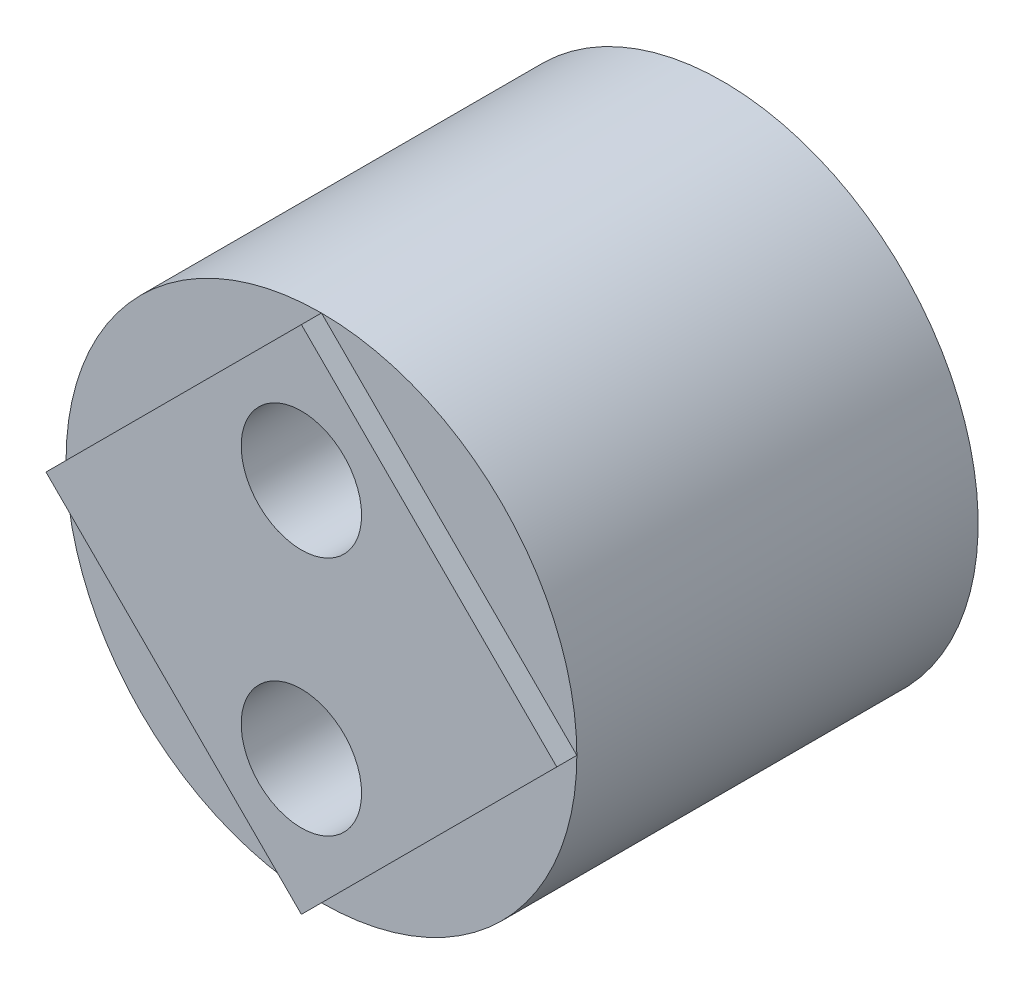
ISO-10303-21;
HEADER;
FILE_DESCRIPTION(('STEP AP214'),'2;1');
FILE_NAME('part.step','',(''),(''),'','','');
FILE_SCHEMA(('AUTOMOTIVE_DESIGN { 1 0 10303 214 1 1 1 1 }'));
ENDSEC;
DATA;
#1=APPLICATION_CONTEXT('core data for automotive mechanical design processes');
#2=APPLICATION_PROTOCOL_DEFINITION('international standard','automotive_design',2000,#1);
#3=PRODUCT_CONTEXT('',#1,'mechanical');
#4=PRODUCT('Part','Part','',(#3));
#5=PRODUCT_RELATED_PRODUCT_CATEGORY('part','',(#4));
#6=PRODUCT_DEFINITION_FORMATION('','',#4);
#7=PRODUCT_DEFINITION_CONTEXT('part definition',#1,'design');
#8=PRODUCT_DEFINITION('design','',#6,#7);
#9=PRODUCT_DEFINITION_SHAPE('','',#8);
#10=(LENGTH_UNIT() NAMED_UNIT(*) SI_UNIT(.MILLI.,.METRE.));
#11=(NAMED_UNIT(*) PLANE_ANGLE_UNIT() SI_UNIT($,.RADIAN.));
#12=(NAMED_UNIT(*) SI_UNIT($,.STERADIAN.) SOLID_ANGLE_UNIT());
#13=UNCERTAINTY_MEASURE_WITH_UNIT(LENGTH_MEASURE(1.E-05),#10,'distance_accuracy_value','');
#14=(GEOMETRIC_REPRESENTATION_CONTEXT(3) GLOBAL_UNCERTAINTY_ASSIGNED_CONTEXT((#13)) GLOBAL_UNIT_ASSIGNED_CONTEXT((#10,
#11,#12)) REPRESENTATION_CONTEXT('',''));
#15=CARTESIAN_POINT('',(0.,0.,0.));
#16=DIRECTION('',(0.,0.,1.));
#17=DIRECTION('',(1.,0.,0.));
#18=AXIS2_PLACEMENT_3D('',#15,#16,#17);
#19=CARTESIAN_POINT('',(0.,0.,-49.));
#20=DIRECTION('',(0.,0.,1.));
#21=DIRECTION('',(1.,0.,0.));
#22=AXIS2_PLACEMENT_3D('',#19,#20,#21);
#23=CYLINDRICAL_SURFACE('',#22,12.7279220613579);
#24=CARTESIAN_POINT('',(0.,0.,20.));
#25=DIRECTION('',(0.,0.,1.));
#26=DIRECTION('',(1.,0.,0.));
#27=AXIS2_PLACEMENT_3D('',#24,#25,#26);
#28=CIRCLE('',#27,12.7279220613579);
#29=CARTESIAN_POINT('',(0.,-12.7279220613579,20.));
#30=VERTEX_POINT('',#29);
#31=CARTESIAN_POINT('',(12.7279220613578,0.,20.));
#32=VERTEX_POINT('',#31);
#33=EDGE_CURVE('E67',#30,#32,#28,.T.);
#34=ORIENTED_EDGE('',*,*,#33,.F.);
#35=CARTESIAN_POINT('',(-12.7279220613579,0.,20.));
#36=VERTEX_POINT('',#35);
#37=EDGE_CURVE('E57',#36,#30,#28,.T.);
#38=ORIENTED_EDGE('',*,*,#37,.F.);
#39=CARTESIAN_POINT('',(0.,12.7279220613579,20.));
#40=VERTEX_POINT('',#39);
#41=EDGE_CURVE('E54',#40,#36,#28,.T.);
#42=ORIENTED_EDGE('',*,*,#41,.F.);
#43=EDGE_CURVE('E29',#32,#40,#28,.T.);
#44=ORIENTED_EDGE('',*,*,#43,.F.);
#45=EDGE_LOOP('',(#34,#38,#42,#44));
#46=FACE_BOUND('',#45,.T.);
#47=CARTESIAN_POINT('',(0.,0.,0.));
#48=DIRECTION('',(0.,0.,-1.));
#49=DIRECTION('',(-1.,0.,0.));
#50=AXIS2_PLACEMENT_3D('',#47,#48,#49);
#51=CIRCLE('',#50,12.7279220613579);
#52=CARTESIAN_POINT('',(-12.7279220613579,0.,0.));
#53=VERTEX_POINT('',#52);
#54=EDGE_CURVE('E60',#53,#53,#51,.T.);
#55=ORIENTED_EDGE('',*,*,#54,.F.);
#56=EDGE_LOOP('',(#55));
#57=FACE_BOUND('',#56,.T.);
#58=ADVANCED_FACE('F14',(#46,#57),#23,.T.);
#59=CARTESIAN_POINT('',(-17.5,-17.5,20.));
#60=DIRECTION('',(0.,0.,1.));
#61=DIRECTION('',(1.,0.,0.));
#62=AXIS2_PLACEMENT_3D('',#59,#60,#61);
#63=PLANE('',#62);
#64=DIRECTION('',(-0.707106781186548,0.707106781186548,0.));
#65=VECTOR('',#64,1.);
#66=CARTESIAN_POINT('',(0.,12.7279220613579,20.));
#67=LINE('',#66,#65);
#68=EDGE_CURVE('E65',#32,#40,#67,.T.);
#69=ORIENTED_EDGE('',*,*,#68,.F.);
#70=ORIENTED_EDGE('',*,*,#43,.T.);
#71=EDGE_LOOP('',(#69,#70));
#72=FACE_BOUND('',#71,.T.);
#73=ADVANCED_FACE('F16',(#72),#63,.T.);
#74=DIRECTION('',(-0.707106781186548,-0.707106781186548,0.));
#75=VECTOR('',#74,1.);
#76=CARTESIAN_POINT('',(-12.7279220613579,0.,20.));
#77=LINE('',#76,#75);
#78=EDGE_CURVE('E84',#40,#36,#77,.T.);
#79=ORIENTED_EDGE('',*,*,#78,.F.);
#80=ORIENTED_EDGE('',*,*,#41,.T.);
#81=EDGE_LOOP('',(#79,#80));
#82=FACE_BOUND('',#81,.T.);
#83=ADVANCED_FACE('F87',(#82),#63,.T.);
#84=DIRECTION('',(0.707106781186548,-0.707106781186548,0.));
#85=VECTOR('',#84,1.);
#86=CARTESIAN_POINT('',(-12.7279220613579,0.,20.));
#87=LINE('',#86,#85);
#88=EDGE_CURVE('E88',#36,#30,#87,.T.);
#89=ORIENTED_EDGE('',*,*,#88,.F.);
#90=ORIENTED_EDGE('',*,*,#37,.T.);
#91=EDGE_LOOP('',(#89,#90));
#92=FACE_BOUND('',#91,.T.);
#93=ADVANCED_FACE('F124',(#92),#63,.T.);
#94=DIRECTION('',(0.707106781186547,0.707106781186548,0.));
#95=VECTOR('',#94,1.);
#96=CARTESIAN_POINT('',(0.,-12.7279220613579,20.));
#97=LINE('',#96,#95);
#98=EDGE_CURVE('E78',#30,#32,#97,.T.);
#99=ORIENTED_EDGE('',*,*,#98,.F.);
#100=ORIENTED_EDGE('',*,*,#33,.T.);
#101=EDGE_LOOP('',(#99,#100));
#102=FACE_BOUND('',#101,.T.);
#103=ADVANCED_FACE('F109',(#102),#63,.T.);
#104=CARTESIAN_POINT('',(-12.7279220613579,0.,21.));
#105=DIRECTION('',(0.707106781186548,-0.707106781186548,0.));
#106=DIRECTION('',(0.707106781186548,0.707106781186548,0.));
#107=AXIS2_PLACEMENT_3D('',#104,#105,#106);
#108=PLANE('',#107);
#109=ORIENTED_EDGE('',*,*,#78,.T.);
#110=DIRECTION('',(0.,0.,-1.));
#111=VECTOR('',#110,1.);
#112=CARTESIAN_POINT('',(-12.7279220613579,0.,21.));
#113=LINE('',#112,#111);
#114=CARTESIAN_POINT('',(-12.7279220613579,0.,21.));
#115=VERTEX_POINT('',#114);
#116=EDGE_CURVE('E9',#115,#36,#113,.T.);
#117=ORIENTED_EDGE('',*,*,#116,.F.);
#118=DIRECTION('',(-0.707106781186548,-0.707106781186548,0.));
#119=VECTOR('',#118,1.);
#120=CARTESIAN_POINT('',(-12.7279220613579,0.,21.));
#121=LINE('',#120,#119);
#122=CARTESIAN_POINT('',(0.,12.7279220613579,21.));
#123=VERTEX_POINT('',#122);
#124=EDGE_CURVE('E77',#123,#115,#121,.T.);
#125=ORIENTED_EDGE('',*,*,#124,.F.);
#126=DIRECTION('',(0.,0.,-1.));
#127=VECTOR('',#126,1.);
#128=CARTESIAN_POINT('',(0.,12.7279220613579,21.));
#129=LINE('',#128,#127);
#130=EDGE_CURVE('E72',#123,#40,#129,.T.);
#131=ORIENTED_EDGE('',*,*,#130,.T.);
#132=EDGE_LOOP('',(#109,#117,#125,#131));
#133=FACE_BOUND('',#132,.T.);
#134=ADVANCED_FACE('F82',(#133),#108,.F.);
#135=CARTESIAN_POINT('',(-12.7279220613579,0.,21.));
#136=DIRECTION('',(0.707106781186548,0.707106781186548,0.));
#137=DIRECTION('',(-0.707106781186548,0.707106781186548,0.));
#138=AXIS2_PLACEMENT_3D('',#135,#136,#137);
#139=PLANE('',#138);
#140=ORIENTED_EDGE('',*,*,#88,.T.);
#141=DIRECTION('',(0.,0.,-1.));
#142=VECTOR('',#141,1.);
#143=CARTESIAN_POINT('',(0.,-12.7279220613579,21.));
#144=LINE('',#143,#142);
#145=CARTESIAN_POINT('',(0.,-12.7279220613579,21.));
#146=VERTEX_POINT('',#145);
#147=EDGE_CURVE('E22',#146,#30,#144,.T.);
#148=ORIENTED_EDGE('',*,*,#147,.F.);
#149=DIRECTION('',(0.707106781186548,-0.707106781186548,0.));
#150=VECTOR('',#149,1.);
#151=CARTESIAN_POINT('',(-12.7279220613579,0.,21.));
#152=LINE('',#151,#150);
#153=EDGE_CURVE('E120',#115,#146,#152,.T.);
#154=ORIENTED_EDGE('',*,*,#153,.F.);
#155=ORIENTED_EDGE('',*,*,#116,.T.);
#156=EDGE_LOOP('',(#140,#148,#154,#155));
#157=FACE_BOUND('',#156,.T.);
#158=ADVANCED_FACE('F122',(#157),#139,.F.);
#159=CARTESIAN_POINT('',(0.,-12.7279220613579,21.));
#160=DIRECTION('',(-0.707106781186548,0.707106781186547,0.));
#161=DIRECTION('',(-0.707106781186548,-0.707106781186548,0.));
#162=AXIS2_PLACEMENT_3D('',#159,#160,#161);
#163=PLANE('',#162);
#164=ORIENTED_EDGE('',*,*,#98,.T.);
#165=DIRECTION('',(0.,0.,-1.));
#166=VECTOR('',#165,1.);
#167=CARTESIAN_POINT('',(12.7279220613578,0.,21.));
#168=LINE('',#167,#166);
#169=CARTESIAN_POINT('',(12.7279220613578,0.,21.));
#170=VERTEX_POINT('',#169);
#171=EDGE_CURVE('E75',#170,#32,#168,.T.);
#172=ORIENTED_EDGE('',*,*,#171,.F.);
#173=DIRECTION('',(0.707106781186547,0.707106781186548,0.));
#174=VECTOR('',#173,1.);
#175=CARTESIAN_POINT('',(0.,-12.7279220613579,21.));
#176=LINE('',#175,#174);
#177=EDGE_CURVE('E106',#146,#170,#176,.T.);
#178=ORIENTED_EDGE('',*,*,#177,.F.);
#179=ORIENTED_EDGE('',*,*,#147,.T.);
#180=EDGE_LOOP('',(#164,#172,#178,#179));
#181=FACE_BOUND('',#180,.T.);
#182=ADVANCED_FACE('F105',(#181),#163,.F.);
#183=CARTESIAN_POINT('',(0.,12.7279220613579,21.));
#184=DIRECTION('',(-0.707106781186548,-0.707106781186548,0.));
#185=DIRECTION('',(0.707106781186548,-0.707106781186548,0.));
#186=AXIS2_PLACEMENT_3D('',#183,#184,#185);
#187=PLANE('',#186);
#188=ORIENTED_EDGE('',*,*,#68,.T.);
#189=ORIENTED_EDGE('',*,*,#130,.F.);
#190=DIRECTION('',(-0.707106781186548,0.707106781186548,0.));
#191=VECTOR('',#190,1.);
#192=CARTESIAN_POINT('',(0.,12.7279220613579,21.));
#193=LINE('',#192,#191);
#194=EDGE_CURVE('E37',#170,#123,#193,.T.);
#195=ORIENTED_EDGE('',*,*,#194,.F.);
#196=ORIENTED_EDGE('',*,*,#171,.T.);
#197=EDGE_LOOP('',(#188,#189,#195,#196));
#198=FACE_BOUND('',#197,.T.);
#199=ADVANCED_FACE('F71',(#198),#187,.F.);
#200=CARTESIAN_POINT('',(0.,12.7279220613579,21.));
#201=DIRECTION('',(0.,0.,-1.));
#202=DIRECTION('',(-1.,0.,0.));
#203=AXIS2_PLACEMENT_3D('',#200,#201,#202);
#204=PLANE('',#203);
#205=CARTESIAN_POINT('',(0.,-6.,21.));
#206=DIRECTION('',(0.,0.,1.));
#207=DIRECTION('',(1.,0.,0.));
#208=AXIS2_PLACEMENT_3D('',#205,#206,#207);
#209=CIRCLE('',#208,3.);
#210=CARTESIAN_POINT('',(3.,-6.,21.));
#211=VERTEX_POINT('',#210);
#212=EDGE_CURVE('E66',#211,#211,#209,.T.);
#213=ORIENTED_EDGE('',*,*,#212,.F.);
#214=EDGE_LOOP('',(#213));
#215=FACE_BOUND('',#214,.T.);
#216=CARTESIAN_POINT('',(0.,6.,21.));
#217=DIRECTION('',(0.,0.,1.));
#218=DIRECTION('',(1.,0.,0.));
#219=AXIS2_PLACEMENT_3D('',#216,#217,#218);
#220=CIRCLE('',#219,3.);
#221=CARTESIAN_POINT('',(3.,6.,21.));
#222=VERTEX_POINT('',#221);
#223=EDGE_CURVE('E94',#222,#222,#220,.T.);
#224=ORIENTED_EDGE('',*,*,#223,.F.);
#225=EDGE_LOOP('',(#224));
#226=FACE_BOUND('',#225,.T.);
#227=ORIENTED_EDGE('',*,*,#124,.T.);
#228=ORIENTED_EDGE('',*,*,#153,.T.);
#229=ORIENTED_EDGE('',*,*,#177,.T.);
#230=ORIENTED_EDGE('',*,*,#194,.T.);
#231=EDGE_LOOP('',(#227,#228,#229,#230));
#232=FACE_BOUND('',#231,.T.);
#233=ADVANCED_FACE('F121',(#215,#226,#232),#204,.F.);
#234=CARTESIAN_POINT('',(0.,6.,7.));
#235=DIRECTION('',(0.,0.,1.));
#236=DIRECTION('',(1.,0.,0.));
#237=AXIS2_PLACEMENT_3D('',#234,#235,#236);
#238=CYLINDRICAL_SURFACE('',#237,3.);
#239=CARTESIAN_POINT('',(0.,6.,7.));
#240=DIRECTION('',(0.,0.,1.));
#241=DIRECTION('',(1.,0.,0.));
#242=AXIS2_PLACEMENT_3D('',#239,#240,#241);
#243=CIRCLE('',#242,3.);
#244=CARTESIAN_POINT('',(3.,6.,7.));
#245=VERTEX_POINT('',#244);
#246=EDGE_CURVE('E89',#245,#245,#243,.T.);
#247=ORIENTED_EDGE('',*,*,#246,.F.);
#248=EDGE_LOOP('',(#247));
#249=FACE_BOUND('',#248,.T.);
#250=ORIENTED_EDGE('',*,*,#223,.T.);
#251=EDGE_LOOP('',(#250));
#252=FACE_BOUND('',#251,.T.);
#253=ADVANCED_FACE('F152',(#249,#252),#238,.F.);
#254=CARTESIAN_POINT('',(0.,6.,7.));
#255=DIRECTION('',(0.,0.,1.));
#256=DIRECTION('',(1.,0.,0.));
#257=AXIS2_PLACEMENT_3D('',#254,#255,#256);
#258=PLANE('',#257);
#259=ORIENTED_EDGE('',*,*,#246,.T.);
#260=EDGE_LOOP('',(#259));
#261=FACE_BOUND('',#260,.T.);
#262=ADVANCED_FACE('F148',(#261),#258,.T.);
#263=CARTESIAN_POINT('',(0.,-6.,7.));
#264=DIRECTION('',(0.,0.,1.));
#265=DIRECTION('',(1.,0.,0.));
#266=AXIS2_PLACEMENT_3D('',#263,#264,#265);
#267=CYLINDRICAL_SURFACE('',#266,3.);
#268=CARTESIAN_POINT('',(0.,-6.,7.));
#269=DIRECTION('',(0.,0.,1.));
#270=DIRECTION('',(1.,0.,0.));
#271=AXIS2_PLACEMENT_3D('',#268,#269,#270);
#272=CIRCLE('',#271,3.);
#273=CARTESIAN_POINT('',(3.,-6.,7.));
#274=VERTEX_POINT('',#273);
#275=EDGE_CURVE('E112',#274,#274,#272,.T.);
#276=ORIENTED_EDGE('',*,*,#275,.F.);
#277=EDGE_LOOP('',(#276));
#278=FACE_BOUND('',#277,.T.);
#279=ORIENTED_EDGE('',*,*,#212,.T.);
#280=EDGE_LOOP('',(#279));
#281=FACE_BOUND('',#280,.T.);
#282=ADVANCED_FACE('F144',(#278,#281),#267,.F.);
#283=CARTESIAN_POINT('',(0.,-6.,7.));
#284=DIRECTION('',(0.,0.,1.));
#285=DIRECTION('',(1.,0.,0.));
#286=AXIS2_PLACEMENT_3D('',#283,#284,#285);
#287=PLANE('',#286);
#288=ORIENTED_EDGE('',*,*,#275,.T.);
#289=EDGE_LOOP('',(#288));
#290=FACE_BOUND('',#289,.T.);
#291=ADVANCED_FACE('F141',(#290),#287,.T.);
#292=CARTESIAN_POINT('',(0.,0.,0.));
#293=DIRECTION('',(0.,0.,-1.));
#294=DIRECTION('',(-1.,0.,0.));
#295=AXIS2_PLACEMENT_3D('',#292,#293,#294);
#296=PLANE('',#295);
#297=ORIENTED_EDGE('',*,*,#54,.T.);
#298=EDGE_LOOP('',(#297));
#299=FACE_BOUND('',#298,.T.);
#300=ADVANCED_FACE('F140',(#299),#296,.T.);
#301=CLOSED_SHELL('',(#58,#73,#83,#93,#103,#134,#158,#182,#199,#233,#253,#262,#282,#291,#300));
#302=MANIFOLD_SOLID_BREP('B1',#301);
#303=ADVANCED_BREP_SHAPE_REPRESENTATION('',(#18,#302),#14);
#304=SHAPE_DEFINITION_REPRESENTATION(#9,#303);
ENDSEC;
END-ISO-10303-21;
